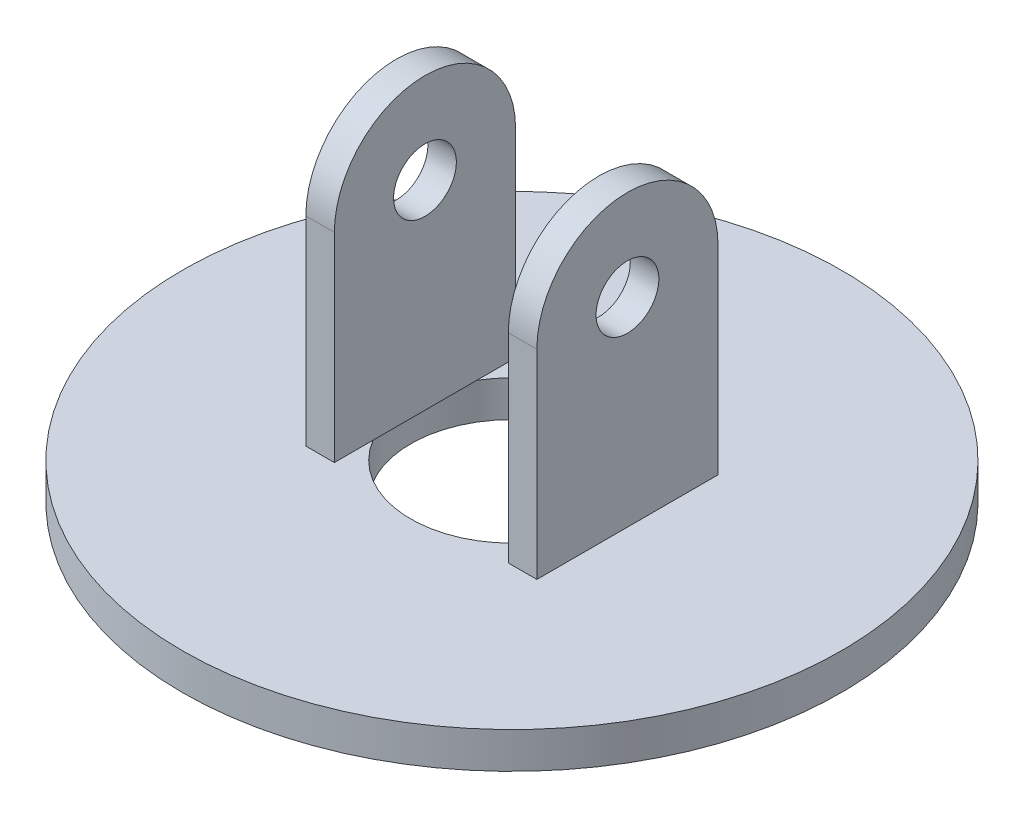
ISO-10303-21;
HEADER;
FILE_DESCRIPTION(('STEP AP214'),'2;1');
FILE_NAME('part.step','',(''),(''),'','','');
FILE_SCHEMA(('AUTOMOTIVE_DESIGN { 1 0 10303 214 1 1 1 1 }'));
ENDSEC;
DATA;
#1=APPLICATION_CONTEXT('core data for automotive mechanical design processes');
#2=APPLICATION_PROTOCOL_DEFINITION('international standard','automotive_design',2000,#1);
#3=PRODUCT_CONTEXT('',#1,'mechanical');
#4=PRODUCT('Part','Part','',(#3));
#5=PRODUCT_RELATED_PRODUCT_CATEGORY('part','',(#4));
#6=PRODUCT_DEFINITION_FORMATION('','',#4);
#7=PRODUCT_DEFINITION_CONTEXT('part definition',#1,'design');
#8=PRODUCT_DEFINITION('design','',#6,#7);
#9=PRODUCT_DEFINITION_SHAPE('','',#8);
#10=(LENGTH_UNIT() NAMED_UNIT(*) SI_UNIT(.MILLI.,.METRE.));
#11=(NAMED_UNIT(*) PLANE_ANGLE_UNIT() SI_UNIT($,.RADIAN.));
#12=(NAMED_UNIT(*) SI_UNIT($,.STERADIAN.) SOLID_ANGLE_UNIT());
#13=UNCERTAINTY_MEASURE_WITH_UNIT(LENGTH_MEASURE(1.E-05),#10,'distance_accuracy_value','');
#14=(GEOMETRIC_REPRESENTATION_CONTEXT(3) GLOBAL_UNCERTAINTY_ASSIGNED_CONTEXT((#13)) GLOBAL_UNIT_ASSIGNED_CONTEXT((#10,
#11,#12)) REPRESENTATION_CONTEXT('',''));
#15=CARTESIAN_POINT('',(0.,0.,0.));
#16=DIRECTION('',(0.,0.,1.));
#17=DIRECTION('',(1.,0.,0.));
#18=AXIS2_PLACEMENT_3D('',#15,#16,#17);
#19=CARTESIAN_POINT('',(-40.48,82.55,0.));
#20=DIRECTION('',(-1.,0.,0.));
#21=DIRECTION('',(0.,0.,1.));
#22=AXIS2_PLACEMENT_3D('',#19,#20,#21);
#23=CYLINDRICAL_SURFACE('',#22,31.75);
#24=DIRECTION('',(-1.,0.,0.));
#25=VECTOR('',#24,1.);
#26=CARTESIAN_POINT('',(-40.48,82.55,-31.75));
#27=LINE('',#26,#25);
#28=CARTESIAN_POINT('',(-40.48,82.55,-31.75));
#29=VERTEX_POINT('',#28);
#30=CARTESIAN_POINT('',(-30.48,82.55,-31.75));
#31=VERTEX_POINT('',#30);
#32=EDGE_CURVE('E198',#29,#31,#27,.F.);
#33=ORIENTED_EDGE('',*,*,#32,.F.);
#34=CARTESIAN_POINT('',(-40.48,82.55,0.));
#35=DIRECTION('',(1.,0.,0.));
#36=DIRECTION('',(0.,0.,-1.));
#37=AXIS2_PLACEMENT_3D('',#34,#35,#36);
#38=CIRCLE('',#37,31.75);
#39=CARTESIAN_POINT('',(-40.48,82.55,31.75));
#40=VERTEX_POINT('',#39);
#41=EDGE_CURVE('E56',#40,#29,#38,.F.);
#42=ORIENTED_EDGE('',*,*,#41,.F.);
#43=DIRECTION('',(-1.,0.,0.));
#44=VECTOR('',#43,1.);
#45=CARTESIAN_POINT('',(-40.48,82.55,31.75));
#46=LINE('',#45,#44);
#47=CARTESIAN_POINT('',(-30.48,82.55,31.75));
#48=VERTEX_POINT('',#47);
#49=EDGE_CURVE('E200',#48,#40,#46,.T.);
#50=ORIENTED_EDGE('',*,*,#49,.F.);
#51=CARTESIAN_POINT('',(-30.48,82.55,0.));
#52=DIRECTION('',(-1.,0.,0.));
#53=DIRECTION('',(0.,0.,1.));
#54=AXIS2_PLACEMENT_3D('',#51,#52,#53);
#55=CIRCLE('',#54,31.75);
#56=EDGE_CURVE('E11',#31,#48,#55,.F.);
#57=ORIENTED_EDGE('',*,*,#56,.F.);
#58=EDGE_LOOP('',(#33,#42,#50,#57));
#59=FACE_BOUND('',#58,.T.);
#60=ADVANCED_FACE('F47',(#59),#23,.T.);
#61=CARTESIAN_POINT('',(40.48,82.55,0.));
#62=DIRECTION('',(1.,0.,0.));
#63=DIRECTION('',(0.,0.,-1.));
#64=AXIS2_PLACEMENT_3D('',#61,#62,#63);
#65=CYLINDRICAL_SURFACE('',#64,31.75);
#66=DIRECTION('',(-1.,0.,0.));
#67=VECTOR('',#66,1.);
#68=CARTESIAN_POINT('',(40.48,82.55,31.75));
#69=LINE('',#68,#67);
#70=CARTESIAN_POINT('',(40.48,82.55,31.75));
#71=VERTEX_POINT('',#70);
#72=CARTESIAN_POINT('',(30.48,82.55,31.75));
#73=VERTEX_POINT('',#72);
#74=EDGE_CURVE('E188',#71,#73,#69,.T.);
#75=ORIENTED_EDGE('',*,*,#74,.F.);
#76=CARTESIAN_POINT('',(40.48,82.55,0.));
#77=DIRECTION('',(-1.,0.,0.));
#78=DIRECTION('',(0.,0.,1.));
#79=AXIS2_PLACEMENT_3D('',#76,#77,#78);
#80=CIRCLE('',#79,31.75);
#81=CARTESIAN_POINT('',(40.48,82.55,-31.75));
#82=VERTEX_POINT('',#81);
#83=EDGE_CURVE('E194',#82,#71,#80,.F.);
#84=ORIENTED_EDGE('',*,*,#83,.F.);
#85=DIRECTION('',(-1.,0.,0.));
#86=VECTOR('',#85,1.);
#87=CARTESIAN_POINT('',(40.48,82.55,-31.75));
#88=LINE('',#87,#86);
#89=CARTESIAN_POINT('',(30.48,82.55,-31.75));
#90=VERTEX_POINT('',#89);
#91=EDGE_CURVE('E191',#90,#82,#88,.F.);
#92=ORIENTED_EDGE('',*,*,#91,.F.);
#93=CARTESIAN_POINT('',(30.48,82.55,0.));
#94=DIRECTION('',(1.,0.,0.));
#95=DIRECTION('',(0.,0.,-1.));
#96=AXIS2_PLACEMENT_3D('',#93,#94,#95);
#97=CIRCLE('',#96,31.75);
#98=EDGE_CURVE('E196',#73,#90,#97,.F.);
#99=ORIENTED_EDGE('',*,*,#98,.F.);
#100=EDGE_LOOP('',(#75,#84,#92,#99));
#101=FACE_BOUND('',#100,.T.);
#102=ADVANCED_FACE('F250',(#101),#65,.T.);
#103=CARTESIAN_POINT('',(0.,12.7,0.));
#104=DIRECTION('',(0.,1.,0.));
#105=DIRECTION('',(0.,0.,1.));
#106=AXIS2_PLACEMENT_3D('',#103,#104,#105);
#107=PLANE('',#106);
#108=CARTESIAN_POINT('',(0.,12.7,0.));
#109=DIRECTION('',(0.,1.,0.));
#110=DIRECTION('',(0.,0.,1.));
#111=AXIS2_PLACEMENT_3D('',#108,#109,#110);
#112=CIRCLE('',#111,115.5);
#113=CARTESIAN_POINT('',(0.,12.7,115.5));
#114=VERTEX_POINT('',#113);
#115=EDGE_CURVE('E183',#114,#114,#112,.T.);
#116=ORIENTED_EDGE('',*,*,#115,.T.);
#117=EDGE_LOOP('',(#116));
#118=FACE_BOUND('',#117,.T.);
#119=CARTESIAN_POINT('',(0.,12.7,0.));
#120=DIRECTION('',(0.,1.,0.));
#121=DIRECTION('',(0.,0.,1.));
#122=AXIS2_PLACEMENT_3D('',#119,#120,#121);
#123=CIRCLE('',#122,35.5);
#124=CARTESIAN_POINT('',(-30.48,12.7,18.1994395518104));
#125=VERTEX_POINT('',#124);
#126=CARTESIAN_POINT('',(30.48,12.7,18.1994395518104));
#127=VERTEX_POINT('',#126);
#128=EDGE_CURVE('E180',#125,#127,#123,.T.);
#129=ORIENTED_EDGE('',*,*,#128,.F.);
#130=DIRECTION('',(0.,0.,-1.));
#131=VECTOR('',#130,1.);
#132=CARTESIAN_POINT('',(-30.48,12.7,31.75));
#133=LINE('',#132,#131);
#134=CARTESIAN_POINT('',(-30.48,12.7,31.75));
#135=VERTEX_POINT('',#134);
#136=EDGE_CURVE('E152',#135,#125,#133,.T.);
#137=ORIENTED_EDGE('',*,*,#136,.F.);
#138=DIRECTION('',(1.,0.,0.));
#139=VECTOR('',#138,1.);
#140=CARTESIAN_POINT('',(-40.48,12.7,31.75));
#141=LINE('',#140,#139);
#142=CARTESIAN_POINT('',(-40.48,12.7,31.75));
#143=VERTEX_POINT('',#142);
#144=EDGE_CURVE('E145',#143,#135,#141,.T.);
#145=ORIENTED_EDGE('',*,*,#144,.F.);
#146=DIRECTION('',(0.,0.,1.));
#147=VECTOR('',#146,1.);
#148=CARTESIAN_POINT('',(-40.48,12.7,31.75));
#149=LINE('',#148,#147);
#150=CARTESIAN_POINT('',(-40.48,12.7,-31.75));
#151=VERTEX_POINT('',#150);
#152=EDGE_CURVE('E127',#151,#143,#149,.T.);
#153=ORIENTED_EDGE('',*,*,#152,.F.);
#154=DIRECTION('',(-1.,0.,0.));
#155=VECTOR('',#154,1.);
#156=CARTESIAN_POINT('',(-40.48,12.7,-31.75));
#157=LINE('',#156,#155);
#158=CARTESIAN_POINT('',(-30.48,12.7,-31.75));
#159=VERTEX_POINT('',#158);
#160=EDGE_CURVE('E131',#159,#151,#157,.T.);
#161=ORIENTED_EDGE('',*,*,#160,.F.);
#162=CARTESIAN_POINT('',(-30.48,12.7,-18.1994395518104));
#163=VERTEX_POINT('',#162);
#164=EDGE_CURVE('E139',#163,#159,#133,.T.);
#165=ORIENTED_EDGE('',*,*,#164,.F.);
#166=CARTESIAN_POINT('',(30.48,12.7,-18.1994395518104));
#167=VERTEX_POINT('',#166);
#168=EDGE_CURVE('E179',#167,#163,#123,.T.);
#169=ORIENTED_EDGE('',*,*,#168,.F.);
#170=DIRECTION('',(0.,0.,1.));
#171=VECTOR('',#170,1.);
#172=CARTESIAN_POINT('',(30.48,12.7,31.75));
#173=LINE('',#172,#171);
#174=CARTESIAN_POINT('',(30.48,12.7,-31.75));
#175=VERTEX_POINT('',#174);
#176=EDGE_CURVE('E149',#175,#167,#173,.T.);
#177=ORIENTED_EDGE('',*,*,#176,.F.);
#178=DIRECTION('',(-1.,0.,0.));
#179=VECTOR('',#178,1.);
#180=CARTESIAN_POINT('',(40.48,12.7,-31.75));
#181=LINE('',#180,#179);
#182=CARTESIAN_POINT('',(40.48,12.7,-31.75));
#183=VERTEX_POINT('',#182);
#184=EDGE_CURVE('E163',#183,#175,#181,.T.);
#185=ORIENTED_EDGE('',*,*,#184,.F.);
#186=DIRECTION('',(0.,0.,-1.));
#187=VECTOR('',#186,1.);
#188=CARTESIAN_POINT('',(40.48,12.7,31.75));
#189=LINE('',#188,#187);
#190=CARTESIAN_POINT('',(40.48,12.7,31.75));
#191=VERTEX_POINT('',#190);
#192=EDGE_CURVE('E160',#191,#183,#189,.T.);
#193=ORIENTED_EDGE('',*,*,#192,.F.);
#194=DIRECTION('',(1.,0.,0.));
#195=VECTOR('',#194,1.);
#196=CARTESIAN_POINT('',(40.48,12.7,31.75));
#197=LINE('',#196,#195);
#198=CARTESIAN_POINT('',(30.48,12.7,31.75));
#199=VERTEX_POINT('',#198);
#200=EDGE_CURVE('E157',#199,#191,#197,.T.);
#201=ORIENTED_EDGE('',*,*,#200,.F.);
#202=EDGE_CURVE('E151',#127,#199,#173,.T.);
#203=ORIENTED_EDGE('',*,*,#202,.F.);
#204=EDGE_LOOP('',(#129,#137,#145,#153,#161,#165,#169,#177,#185,#193,#201,#203));
#205=FACE_BOUND('',#204,.T.);
#206=ADVANCED_FACE('F142',(#118,#205),#107,.T.);
#207=CARTESIAN_POINT('',(0.,0.,0.));
#208=DIRECTION('',(0.,1.,0.));
#209=DIRECTION('',(0.,0.,1.));
#210=AXIS2_PLACEMENT_3D('',#207,#208,#209);
#211=PLANE('',#210);
#212=CARTESIAN_POINT('',(0.,0.,0.));
#213=DIRECTION('',(0.,1.,0.));
#214=DIRECTION('',(0.,0.,1.));
#215=AXIS2_PLACEMENT_3D('',#212,#213,#214);
#216=CIRCLE('',#215,115.5);
#217=CARTESIAN_POINT('',(0.,0.,115.5));
#218=VERTEX_POINT('',#217);
#219=EDGE_CURVE('E178',#218,#218,#216,.T.);
#220=ORIENTED_EDGE('',*,*,#219,.F.);
#221=EDGE_LOOP('',(#220));
#222=FACE_BOUND('',#221,.T.);
#223=CARTESIAN_POINT('',(0.,0.,0.));
#224=DIRECTION('',(0.,1.,0.));
#225=DIRECTION('',(0.,0.,1.));
#226=AXIS2_PLACEMENT_3D('',#223,#224,#225);
#227=CIRCLE('',#226,35.5);
#228=CARTESIAN_POINT('',(0.,0.,35.5));
#229=VERTEX_POINT('',#228);
#230=EDGE_CURVE('E174',#229,#229,#227,.T.);
#231=ORIENTED_EDGE('',*,*,#230,.T.);
#232=EDGE_LOOP('',(#231));
#233=FACE_BOUND('',#232,.T.);
#234=ADVANCED_FACE('F257',(#222,#233),#211,.F.);
#235=CARTESIAN_POINT('',(0.,12.7,0.));
#236=DIRECTION('',(0.,-1.,0.));
#237=DIRECTION('',(0.,0.,-1.));
#238=AXIS2_PLACEMENT_3D('',#235,#236,#237);
#239=CYLINDRICAL_SURFACE('',#238,115.5);
#240=ORIENTED_EDGE('',*,*,#115,.F.);
#241=EDGE_LOOP('',(#240));
#242=FACE_BOUND('',#241,.T.);
#243=ORIENTED_EDGE('',*,*,#219,.T.);
#244=EDGE_LOOP('',(#243));
#245=FACE_BOUND('',#244,.T.);
#246=ADVANCED_FACE('F265',(#242,#245),#239,.T.);
#247=CARTESIAN_POINT('',(0.,12.7,0.));
#248=DIRECTION('',(0.,-1.,0.));
#249=DIRECTION('',(0.,0.,-1.));
#250=AXIS2_PLACEMENT_3D('',#247,#248,#249);
#251=CYLINDRICAL_SURFACE('',#250,35.5);
#252=EDGE_CURVE('E175',#127,#167,#123,.T.);
#253=ORIENTED_EDGE('',*,*,#252,.T.);
#254=ORIENTED_EDGE('',*,*,#168,.T.);
#255=EDGE_CURVE('E225',#163,#125,#123,.T.);
#256=ORIENTED_EDGE('',*,*,#255,.T.);
#257=ORIENTED_EDGE('',*,*,#128,.T.);
#258=EDGE_LOOP('',(#253,#254,#256,#257));
#259=FACE_BOUND('',#258,.T.);
#260=ORIENTED_EDGE('',*,*,#230,.F.);
#261=EDGE_LOOP('',(#260));
#262=FACE_BOUND('',#261,.T.);
#263=ADVANCED_FACE('F223',(#259,#262),#251,.F.);
#264=CARTESIAN_POINT('',(30.48,114.3,31.75));
#265=DIRECTION('',(1.,0.,0.));
#266=DIRECTION('',(0.,0.,-1.));
#267=AXIS2_PLACEMENT_3D('',#264,#265,#266);
#268=PLANE('',#267);
#269=CARTESIAN_POINT('',(30.48,82.55,0.));
#270=DIRECTION('',(1.,0.,0.));
#271=DIRECTION('',(0.,0.,-1.));
#272=AXIS2_PLACEMENT_3D('',#269,#270,#271);
#273=CIRCLE('',#272,11.);
#274=CARTESIAN_POINT('',(30.48,82.55,-11.));
#275=VERTEX_POINT('',#274);
#276=EDGE_CURVE('E207',#275,#275,#273,.T.);
#277=ORIENTED_EDGE('',*,*,#276,.T.);
#278=EDGE_LOOP('',(#277));
#279=FACE_BOUND('',#278,.T.);
#280=DIRECTION('',(0.,-1.,0.));
#281=VECTOR('',#280,1.);
#282=CARTESIAN_POINT('',(30.48,114.3,31.75));
#283=LINE('',#282,#281);
#284=EDGE_CURVE('E172',#73,#199,#283,.T.);
#285=ORIENTED_EDGE('',*,*,#284,.F.);
#286=ORIENTED_EDGE('',*,*,#98,.T.);
#287=DIRECTION('',(0.,-1.,0.));
#288=VECTOR('',#287,1.);
#289=CARTESIAN_POINT('',(30.48,114.3,-31.75));
#290=LINE('',#289,#288);
#291=EDGE_CURVE('E166',#90,#175,#290,.T.);
#292=ORIENTED_EDGE('',*,*,#291,.T.);
#293=ORIENTED_EDGE('',*,*,#176,.T.);
#294=EDGE_CURVE('E146',#167,#127,#173,.T.);
#295=ORIENTED_EDGE('',*,*,#294,.T.);
#296=ORIENTED_EDGE('',*,*,#202,.T.);
#297=EDGE_LOOP('',(#285,#286,#292,#293,#295,#296));
#298=FACE_BOUND('',#297,.T.);
#299=ADVANCED_FACE('F236',(#279,#298),#268,.F.);
#300=CARTESIAN_POINT('',(40.48,114.3,31.75));
#301=DIRECTION('',(0.,0.,-1.));
#302=DIRECTION('',(-1.,0.,0.));
#303=AXIS2_PLACEMENT_3D('',#300,#301,#302);
#304=PLANE('',#303);
#305=DIRECTION('',(0.,-1.,0.));
#306=VECTOR('',#305,1.);
#307=CARTESIAN_POINT('',(40.48,114.3,31.75));
#308=LINE('',#307,#306);
#309=EDGE_CURVE('E170',#71,#191,#308,.T.);
#310=ORIENTED_EDGE('',*,*,#309,.F.);
#311=ORIENTED_EDGE('',*,*,#74,.T.);
#312=ORIENTED_EDGE('',*,*,#284,.T.);
#313=ORIENTED_EDGE('',*,*,#200,.T.);
#314=EDGE_LOOP('',(#310,#311,#312,#313));
#315=FACE_BOUND('',#314,.T.);
#316=ADVANCED_FACE('F248',(#315),#304,.F.);
#317=CARTESIAN_POINT('',(40.48,114.3,31.75));
#318=DIRECTION('',(-1.,0.,0.));
#319=DIRECTION('',(0.,0.,1.));
#320=AXIS2_PLACEMENT_3D('',#317,#318,#319);
#321=PLANE('',#320);
#322=CARTESIAN_POINT('',(40.48,82.55,0.));
#323=DIRECTION('',(-1.,0.,0.));
#324=DIRECTION('',(0.,0.,1.));
#325=AXIS2_PLACEMENT_3D('',#322,#323,#324);
#326=CIRCLE('',#325,11.);
#327=CARTESIAN_POINT('',(40.48,82.55,11.));
#328=VERTEX_POINT('',#327);
#329=EDGE_CURVE('E211',#328,#328,#326,.T.);
#330=ORIENTED_EDGE('',*,*,#329,.T.);
#331=EDGE_LOOP('',(#330));
#332=FACE_BOUND('',#331,.T.);
#333=DIRECTION('',(0.,-1.,0.));
#334=VECTOR('',#333,1.);
#335=CARTESIAN_POINT('',(40.48,114.3,-31.75));
#336=LINE('',#335,#334);
#337=EDGE_CURVE('E168',#82,#183,#336,.T.);
#338=ORIENTED_EDGE('',*,*,#337,.F.);
#339=ORIENTED_EDGE('',*,*,#83,.T.);
#340=ORIENTED_EDGE('',*,*,#309,.T.);
#341=ORIENTED_EDGE('',*,*,#192,.T.);
#342=EDGE_LOOP('',(#338,#339,#340,#341));
#343=FACE_BOUND('',#342,.T.);
#344=ADVANCED_FACE('F244',(#332,#343),#321,.F.);
#345=CARTESIAN_POINT('',(40.48,114.3,-31.75));
#346=DIRECTION('',(0.,0.,1.));
#347=DIRECTION('',(1.,0.,0.));
#348=AXIS2_PLACEMENT_3D('',#345,#346,#347);
#349=PLANE('',#348);
#350=ORIENTED_EDGE('',*,*,#291,.F.);
#351=ORIENTED_EDGE('',*,*,#91,.T.);
#352=ORIENTED_EDGE('',*,*,#337,.T.);
#353=ORIENTED_EDGE('',*,*,#184,.T.);
#354=EDGE_LOOP('',(#350,#351,#352,#353));
#355=FACE_BOUND('',#354,.T.);
#356=ADVANCED_FACE('F240',(#355),#349,.F.);
#357=CARTESIAN_POINT('',(0.,12.7,0.));
#358=DIRECTION('',(0.,1.,0.));
#359=DIRECTION('',(0.,0.,1.));
#360=AXIS2_PLACEMENT_3D('',#357,#358,#359);
#361=PLANE('',#360);
#362=ORIENTED_EDGE('',*,*,#252,.F.);
#363=ORIENTED_EDGE('',*,*,#294,.F.);
#364=EDGE_LOOP('',(#362,#363));
#365=FACE_BOUND('',#364,.T.);
#366=ADVANCED_FACE('F235',(#365),#361,.F.);
#367=CARTESIAN_POINT('',(0.,12.7,0.));
#368=DIRECTION('',(0.,-1.,0.));
#369=DIRECTION('',(0.,0.,-1.));
#370=AXIS2_PLACEMENT_3D('',#367,#368,#369);
#371=PLANE('',#370);
#372=EDGE_CURVE('E215',#125,#163,#133,.T.);
#373=ORIENTED_EDGE('',*,*,#372,.F.);
#374=ORIENTED_EDGE('',*,*,#255,.F.);
#375=EDGE_LOOP('',(#373,#374));
#376=FACE_BOUND('',#375,.T.);
#377=ADVANCED_FACE('F285',(#376),#371,.T.);
#378=CARTESIAN_POINT('',(-40.48,114.3,31.75));
#379=DIRECTION('',(1.,0.,0.));
#380=DIRECTION('',(0.,0.,-1.));
#381=AXIS2_PLACEMENT_3D('',#378,#379,#380);
#382=PLANE('',#381);
#383=CARTESIAN_POINT('',(-40.48,82.55,0.));
#384=DIRECTION('',(-1.,0.,0.));
#385=DIRECTION('',(0.,0.,1.));
#386=AXIS2_PLACEMENT_3D('',#383,#384,#385);
#387=CIRCLE('',#386,11.);
#388=CARTESIAN_POINT('',(-40.48,82.55,11.));
#389=VERTEX_POINT('',#388);
#390=EDGE_CURVE('E311',#389,#389,#387,.T.);
#391=ORIENTED_EDGE('',*,*,#390,.F.);
#392=EDGE_LOOP('',(#391));
#393=FACE_BOUND('',#392,.T.);
#394=DIRECTION('',(0.,-1.,0.));
#395=VECTOR('',#394,1.);
#396=CARTESIAN_POINT('',(-40.48,114.3,31.75));
#397=LINE('',#396,#395);
#398=EDGE_CURVE('E205',#40,#143,#397,.T.);
#399=ORIENTED_EDGE('',*,*,#398,.F.);
#400=ORIENTED_EDGE('',*,*,#41,.T.);
#401=DIRECTION('',(0.,-1.,0.));
#402=VECTOR('',#401,1.);
#403=CARTESIAN_POINT('',(-40.48,114.3,-31.75));
#404=LINE('',#403,#402);
#405=EDGE_CURVE('E122',#29,#151,#404,.T.);
#406=ORIENTED_EDGE('',*,*,#405,.T.);
#407=ORIENTED_EDGE('',*,*,#152,.T.);
#408=EDGE_LOOP('',(#399,#400,#406,#407));
#409=FACE_BOUND('',#408,.T.);
#410=ADVANCED_FACE('F125',(#393,#409),#382,.F.);
#411=CARTESIAN_POINT('',(-40.48,114.3,31.75));
#412=DIRECTION('',(0.,0.,-1.));
#413=DIRECTION('',(-1.,0.,0.));
#414=AXIS2_PLACEMENT_3D('',#411,#412,#413);
#415=PLANE('',#414);
#416=DIRECTION('',(0.,-1.,0.));
#417=VECTOR('',#416,1.);
#418=CARTESIAN_POINT('',(-30.48,114.3,31.75));
#419=LINE('',#418,#417);
#420=EDGE_CURVE('E206',#48,#135,#419,.T.);
#421=ORIENTED_EDGE('',*,*,#420,.F.);
#422=ORIENTED_EDGE('',*,*,#49,.T.);
#423=ORIENTED_EDGE('',*,*,#398,.T.);
#424=ORIENTED_EDGE('',*,*,#144,.T.);
#425=EDGE_LOOP('',(#421,#422,#423,#424));
#426=FACE_BOUND('',#425,.T.);
#427=ADVANCED_FACE('F204',(#426),#415,.F.);
#428=CARTESIAN_POINT('',(-30.48,114.3,31.75));
#429=DIRECTION('',(-1.,0.,0.));
#430=DIRECTION('',(0.,0.,1.));
#431=AXIS2_PLACEMENT_3D('',#428,#429,#430);
#432=PLANE('',#431);
#433=CARTESIAN_POINT('',(-30.48,82.55,0.));
#434=DIRECTION('',(-1.,0.,0.));
#435=DIRECTION('',(0.,0.,1.));
#436=AXIS2_PLACEMENT_3D('',#433,#434,#435);
#437=CIRCLE('',#436,11.);
#438=CARTESIAN_POINT('',(-30.48,82.55,11.));
#439=VERTEX_POINT('',#438);
#440=EDGE_CURVE('E51',#439,#439,#437,.T.);
#441=ORIENTED_EDGE('',*,*,#440,.T.);
#442=EDGE_LOOP('',(#441));
#443=FACE_BOUND('',#442,.T.);
#444=DIRECTION('',(0.,-1.,0.));
#445=VECTOR('',#444,1.);
#446=CARTESIAN_POINT('',(-30.48,114.3,-31.75));
#447=LINE('',#446,#445);
#448=EDGE_CURVE('E132',#31,#159,#447,.T.);
#449=ORIENTED_EDGE('',*,*,#448,.F.);
#450=ORIENTED_EDGE('',*,*,#56,.T.);
#451=ORIENTED_EDGE('',*,*,#420,.T.);
#452=ORIENTED_EDGE('',*,*,#136,.T.);
#453=ORIENTED_EDGE('',*,*,#372,.T.);
#454=ORIENTED_EDGE('',*,*,#164,.T.);
#455=EDGE_LOOP('',(#449,#450,#451,#452,#453,#454));
#456=FACE_BOUND('',#455,.T.);
#457=ADVANCED_FACE('F218',(#443,#456),#432,.F.);
#458=CARTESIAN_POINT('',(-40.48,114.3,-31.75));
#459=DIRECTION('',(0.,0.,1.));
#460=DIRECTION('',(1.,0.,0.));
#461=AXIS2_PLACEMENT_3D('',#458,#459,#460);
#462=PLANE('',#461);
#463=ORIENTED_EDGE('',*,*,#405,.F.);
#464=ORIENTED_EDGE('',*,*,#32,.T.);
#465=ORIENTED_EDGE('',*,*,#448,.T.);
#466=ORIENTED_EDGE('',*,*,#160,.T.);
#467=EDGE_LOOP('',(#463,#464,#465,#466));
#468=FACE_BOUND('',#467,.T.);
#469=ADVANCED_FACE('F135',(#468),#462,.F.);
#470=CARTESIAN_POINT('',(61.12,82.55,0.));
#471=DIRECTION('',(-1.,0.,0.));
#472=DIRECTION('',(0.,0.,1.));
#473=AXIS2_PLACEMENT_3D('',#470,#471,#472);
#474=CYLINDRICAL_SURFACE('',#473,11.);
#475=ORIENTED_EDGE('',*,*,#390,.T.);
#476=EDGE_LOOP('',(#475));
#477=FACE_BOUND('',#476,.T.);
#478=ORIENTED_EDGE('',*,*,#440,.F.);
#479=EDGE_LOOP('',(#478));
#480=FACE_BOUND('',#479,.T.);
#481=ADVANCED_FACE('F290',(#477,#480),#474,.F.);
#482=ORIENTED_EDGE('',*,*,#329,.F.);
#483=EDGE_LOOP('',(#482));
#484=FACE_BOUND('',#483,.T.);
#485=ORIENTED_EDGE('',*,*,#276,.F.);
#486=EDGE_LOOP('',(#485));
#487=FACE_BOUND('',#486,.T.);
#488=ADVANCED_FACE('F299',(#484,#487),#474,.F.);
#489=CLOSED_SHELL('',(#60,#102,#206,#234,#246,#263,#299,#316,#344,#356,#366,#377,#410,#427,#457,
#469,#481,#488));
#490=MANIFOLD_SOLID_BREP('B2',#489);
#491=ADVANCED_BREP_SHAPE_REPRESENTATION('',(#18,#490),#14);
#492=SHAPE_DEFINITION_REPRESENTATION(#9,#491);
ENDSEC;
END-ISO-10303-21;
